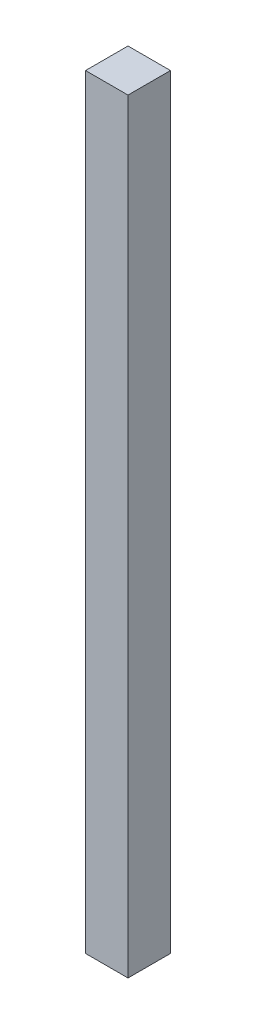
ISO-10303-21;
HEADER;
FILE_DESCRIPTION(('STEP AP214'),'2;1');
FILE_NAME('part.step','',(''),(''),'','','');
FILE_SCHEMA(('AUTOMOTIVE_DESIGN { 1 0 10303 214 1 1 1 1 }'));
ENDSEC;
DATA;
#1=APPLICATION_CONTEXT('core data for automotive mechanical design processes');
#2=APPLICATION_PROTOCOL_DEFINITION('international standard','automotive_design',2000,#1);
#3=PRODUCT_CONTEXT('',#1,'mechanical');
#4=PRODUCT('Part','Part','',(#3));
#5=PRODUCT_RELATED_PRODUCT_CATEGORY('part','',(#4));
#6=PRODUCT_DEFINITION_FORMATION('','',#4);
#7=PRODUCT_DEFINITION_CONTEXT('part definition',#1,'design');
#8=PRODUCT_DEFINITION('design','',#6,#7);
#9=PRODUCT_DEFINITION_SHAPE('','',#8);
#10=(LENGTH_UNIT() NAMED_UNIT(*) SI_UNIT(.MILLI.,.METRE.));
#11=(NAMED_UNIT(*) PLANE_ANGLE_UNIT() SI_UNIT($,.RADIAN.));
#12=(NAMED_UNIT(*) SI_UNIT($,.STERADIAN.) SOLID_ANGLE_UNIT());
#13=UNCERTAINTY_MEASURE_WITH_UNIT(LENGTH_MEASURE(1.E-05),#10,'distance_accuracy_value','');
#14=(GEOMETRIC_REPRESENTATION_CONTEXT(3) GLOBAL_UNCERTAINTY_ASSIGNED_CONTEXT((#13)) GLOBAL_UNIT_ASSIGNED_CONTEXT((#10,
#11,#12)) REPRESENTATION_CONTEXT('',''));
#15=CARTESIAN_POINT('',(0.,0.,0.));
#16=DIRECTION('',(0.,0.,1.));
#17=DIRECTION('',(1.,0.,0.));
#18=AXIS2_PLACEMENT_3D('',#15,#16,#17);
#19=CARTESIAN_POINT('',(3.175,114.3,-3.175));
#20=DIRECTION('',(-1.,0.,0.));
#21=DIRECTION('',(0.,0.,1.));
#22=AXIS2_PLACEMENT_3D('',#19,#20,#21);
#23=PLANE('',#22);
#24=DIRECTION('',(0.,0.,-1.));
#25=VECTOR('',#24,1.);
#26=CARTESIAN_POINT('',(3.175,0.,-3.175));
#27=LINE('',#26,#25);
#28=CARTESIAN_POINT('',(3.175,0.,3.175));
#29=VERTEX_POINT('',#28);
#30=CARTESIAN_POINT('',(3.175,0.,-3.175));
#31=VERTEX_POINT('',#30);
#32=EDGE_CURVE('E100',#29,#31,#27,.T.);
#33=ORIENTED_EDGE('',*,*,#32,.T.);
#34=DIRECTION('',(0.,-1.,0.));
#35=VECTOR('',#34,1.);
#36=CARTESIAN_POINT('',(3.175,114.3,-3.175));
#37=LINE('',#36,#35);
#38=CARTESIAN_POINT('',(3.175,114.3,-3.175));
#39=VERTEX_POINT('',#38);
#40=EDGE_CURVE('E11',#39,#31,#37,.T.);
#41=ORIENTED_EDGE('',*,*,#40,.F.);
#42=DIRECTION('',(0.,0.,-1.));
#43=VECTOR('',#42,1.);
#44=CARTESIAN_POINT('',(3.175,114.3,-3.175));
#45=LINE('',#44,#43);
#46=CARTESIAN_POINT('',(3.175,114.3,3.175));
#47=VERTEX_POINT('',#46);
#48=EDGE_CURVE('E88',#47,#39,#45,.T.);
#49=ORIENTED_EDGE('',*,*,#48,.F.);
#50=DIRECTION('',(0.,-1.,0.));
#51=VECTOR('',#50,1.);
#52=CARTESIAN_POINT('',(3.175,114.3,3.175));
#53=LINE('',#52,#51);
#54=EDGE_CURVE('E96',#47,#29,#53,.T.);
#55=ORIENTED_EDGE('',*,*,#54,.T.);
#56=EDGE_LOOP('',(#33,#41,#49,#55));
#57=FACE_BOUND('',#56,.T.);
#58=ADVANCED_FACE('F37',(#57),#23,.F.);
#59=CARTESIAN_POINT('',(-3.175,114.3,-3.175));
#60=DIRECTION('',(0.,0.,1.));
#61=DIRECTION('',(1.,0.,0.));
#62=AXIS2_PLACEMENT_3D('',#59,#60,#61);
#63=PLANE('',#62);
#64=DIRECTION('',(-1.,0.,0.));
#65=VECTOR('',#64,1.);
#66=CARTESIAN_POINT('',(-3.175,0.,-3.175));
#67=LINE('',#66,#65);
#68=CARTESIAN_POINT('',(-3.175,0.,-3.175));
#69=VERTEX_POINT('',#68);
#70=EDGE_CURVE('E92',#31,#69,#67,.T.);
#71=ORIENTED_EDGE('',*,*,#70,.T.);
#72=DIRECTION('',(0.,-1.,0.));
#73=VECTOR('',#72,1.);
#74=CARTESIAN_POINT('',(-3.175,114.3,-3.175));
#75=LINE('',#74,#73);
#76=CARTESIAN_POINT('',(-3.175,114.3,-3.175));
#77=VERTEX_POINT('',#76);
#78=EDGE_CURVE('E45',#77,#69,#75,.T.);
#79=ORIENTED_EDGE('',*,*,#78,.F.);
#80=DIRECTION('',(-1.,0.,0.));
#81=VECTOR('',#80,1.);
#82=CARTESIAN_POINT('',(-3.175,114.3,-3.175));
#83=LINE('',#82,#81);
#84=EDGE_CURVE('E83',#39,#77,#83,.T.);
#85=ORIENTED_EDGE('',*,*,#84,.F.);
#86=ORIENTED_EDGE('',*,*,#40,.T.);
#87=EDGE_LOOP('',(#71,#79,#85,#86));
#88=FACE_BOUND('',#87,.T.);
#89=ADVANCED_FACE('F91',(#88),#63,.F.);
#90=CARTESIAN_POINT('',(-3.175,114.3,-3.175));
#91=DIRECTION('',(1.,0.,0.));
#92=DIRECTION('',(0.,0.,-1.));
#93=AXIS2_PLACEMENT_3D('',#90,#91,#92);
#94=PLANE('',#93);
#95=DIRECTION('',(0.,0.,1.));
#96=VECTOR('',#95,1.);
#97=CARTESIAN_POINT('',(-3.175,0.,-3.175));
#98=LINE('',#97,#96);
#99=CARTESIAN_POINT('',(-3.175,0.,3.175));
#100=VERTEX_POINT('',#99);
#101=EDGE_CURVE('E70',#69,#100,#98,.T.);
#102=ORIENTED_EDGE('',*,*,#101,.T.);
#103=DIRECTION('',(0.,-1.,0.));
#104=VECTOR('',#103,1.);
#105=CARTESIAN_POINT('',(-3.175,114.3,3.175));
#106=LINE('',#105,#104);
#107=CARTESIAN_POINT('',(-3.175,114.3,3.175));
#108=VERTEX_POINT('',#107);
#109=EDGE_CURVE('E93',#108,#100,#106,.T.);
#110=ORIENTED_EDGE('',*,*,#109,.F.);
#111=DIRECTION('',(0.,0.,1.));
#112=VECTOR('',#111,1.);
#113=CARTESIAN_POINT('',(-3.175,114.3,-3.175));
#114=LINE('',#113,#112);
#115=EDGE_CURVE('E86',#77,#108,#114,.T.);
#116=ORIENTED_EDGE('',*,*,#115,.F.);
#117=ORIENTED_EDGE('',*,*,#78,.T.);
#118=EDGE_LOOP('',(#102,#110,#116,#117));
#119=FACE_BOUND('',#118,.T.);
#120=ADVANCED_FACE('F94',(#119),#94,.F.);
#121=CARTESIAN_POINT('',(-3.175,114.3,3.175));
#122=DIRECTION('',(0.,0.,-1.));
#123=DIRECTION('',(-1.,0.,0.));
#124=AXIS2_PLACEMENT_3D('',#121,#122,#123);
#125=PLANE('',#124);
#126=DIRECTION('',(1.,0.,0.));
#127=VECTOR('',#126,1.);
#128=CARTESIAN_POINT('',(-3.175,0.,3.175));
#129=LINE('',#128,#127);
#130=EDGE_CURVE('E76',#100,#29,#129,.T.);
#131=ORIENTED_EDGE('',*,*,#130,.T.);
#132=ORIENTED_EDGE('',*,*,#54,.F.);
#133=DIRECTION('',(1.,0.,0.));
#134=VECTOR('',#133,1.);
#135=CARTESIAN_POINT('',(-3.175,114.3,3.175));
#136=LINE('',#135,#134);
#137=EDGE_CURVE('E53',#108,#47,#136,.T.);
#138=ORIENTED_EDGE('',*,*,#137,.F.);
#139=ORIENTED_EDGE('',*,*,#109,.T.);
#140=EDGE_LOOP('',(#131,#132,#138,#139));
#141=FACE_BOUND('',#140,.T.);
#142=ADVANCED_FACE('F107',(#141),#125,.F.);
#143=CARTESIAN_POINT('',(0.,114.3,0.));
#144=DIRECTION('',(0.,1.,0.));
#145=DIRECTION('',(0.,0.,1.));
#146=AXIS2_PLACEMENT_3D('',#143,#144,#145);
#147=PLANE('',#146);
#148=ORIENTED_EDGE('',*,*,#48,.T.);
#149=ORIENTED_EDGE('',*,*,#84,.T.);
#150=ORIENTED_EDGE('',*,*,#115,.T.);
#151=ORIENTED_EDGE('',*,*,#137,.T.);
#152=EDGE_LOOP('',(#148,#149,#150,#151));
#153=FACE_BOUND('',#152,.T.);
#154=ADVANCED_FACE('F84',(#153),#147,.T.);
#155=CARTESIAN_POINT('',(0.,0.,0.));
#156=DIRECTION('',(0.,1.,0.));
#157=DIRECTION('',(0.,0.,1.));
#158=AXIS2_PLACEMENT_3D('',#155,#156,#157);
#159=PLANE('',#158);
#160=ORIENTED_EDGE('',*,*,#32,.F.);
#161=ORIENTED_EDGE('',*,*,#130,.F.);
#162=ORIENTED_EDGE('',*,*,#101,.F.);
#163=ORIENTED_EDGE('',*,*,#70,.F.);
#164=EDGE_LOOP('',(#160,#161,#162,#163));
#165=FACE_BOUND('',#164,.T.);
#166=ADVANCED_FACE('F110',(#165),#159,.F.);
#167=CLOSED_SHELL('',(#58,#89,#120,#142,#154,#166));
#168=MANIFOLD_SOLID_BREP('B2',#167);
#169=ADVANCED_BREP_SHAPE_REPRESENTATION('',(#18,#168),#14);
#170=SHAPE_DEFINITION_REPRESENTATION(#9,#169);
ENDSEC;
END-ISO-10303-21;
